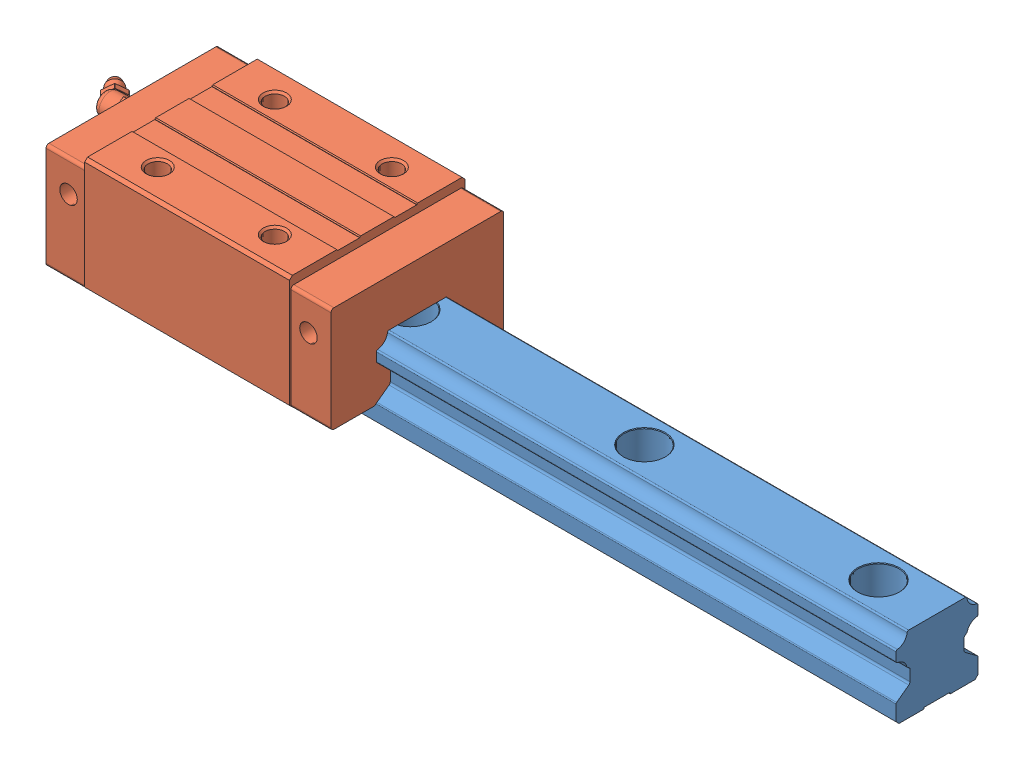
SolidWorks assembly HLH30CA.stp.sldasm, configuration 默认 (file format 13000). Lengths in mm.
Overall size (289.43 45 60).
2 component instances, 2 part files, 0 mates.
Components (placement in the parent):
- HLR30R280 E=20-1: HLR30R280 E=20.SLDPRT [默认] at origin size (280 26 28)
- HLH30CA-1: HLH30CA.SLDPRT [默认] at (5 6 0) size (111.83 39 60)
